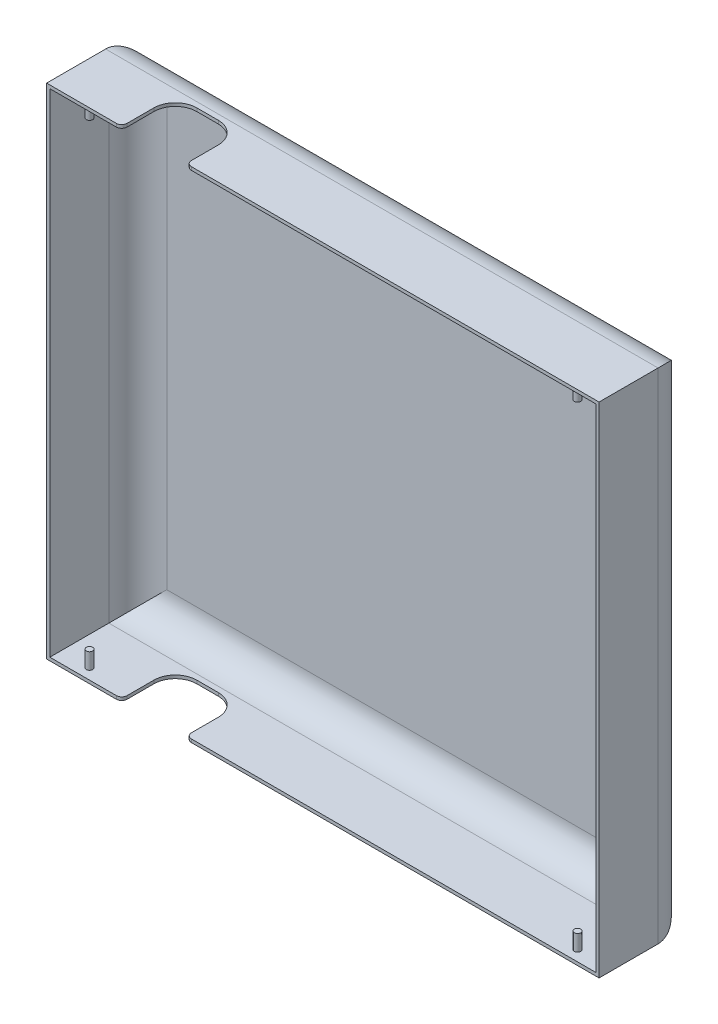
ISO-10303-21;
HEADER;
FILE_DESCRIPTION(('STEP AP214'),'2;1');
FILE_NAME('part.step','',(''),(''),'','','');
FILE_SCHEMA(('AUTOMOTIVE_DESIGN { 1 0 10303 214 1 1 1 1 }'));
ENDSEC;
DATA;
#1=APPLICATION_CONTEXT('core data for automotive mechanical design processes');
#2=APPLICATION_PROTOCOL_DEFINITION('international standard','automotive_design',2000,#1);
#3=PRODUCT_CONTEXT('',#1,'mechanical');
#4=PRODUCT('Part','Part','',(#3));
#5=PRODUCT_RELATED_PRODUCT_CATEGORY('part','',(#4));
#6=PRODUCT_DEFINITION_FORMATION('','',#4);
#7=PRODUCT_DEFINITION_CONTEXT('part definition',#1,'design');
#8=PRODUCT_DEFINITION('design','',#6,#7);
#9=PRODUCT_DEFINITION_SHAPE('','',#8);
#10=(LENGTH_UNIT() NAMED_UNIT(*) SI_UNIT(.MILLI.,.METRE.));
#11=(NAMED_UNIT(*) PLANE_ANGLE_UNIT() SI_UNIT($,.RADIAN.));
#12=(NAMED_UNIT(*) SI_UNIT($,.STERADIAN.) SOLID_ANGLE_UNIT());
#13=UNCERTAINTY_MEASURE_WITH_UNIT(LENGTH_MEASURE(1.E-05),#10,'distance_accuracy_value','');
#14=(GEOMETRIC_REPRESENTATION_CONTEXT(3) GLOBAL_UNCERTAINTY_ASSIGNED_CONTEXT((#13)) GLOBAL_UNIT_ASSIGNED_CONTEXT((#10,
#11,#12)) REPRESENTATION_CONTEXT('',''));
#15=CARTESIAN_POINT('',(0.,0.,0.));
#16=DIRECTION('',(0.,0.,1.));
#17=DIRECTION('',(1.,0.,0.));
#18=AXIS2_PLACEMENT_3D('',#15,#16,#17);
#19=CARTESIAN_POINT('',(0.,-3.,85.));
#20=DIRECTION('',(0.,-1.,0.));
#21=DIRECTION('',(0.,0.,-1.));
#22=AXIS2_PLACEMENT_3D('',#19,#20,#21);
#23=PLANE('',#22);
#24=CARTESIAN_POINT('',(30.,-3.,74.9999999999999));
#25=DIRECTION('',(0.,-1.,0.));
#26=DIRECTION('',(0.,0.,-1.));
#27=AXIS2_PLACEMENT_3D('',#24,#25,#26);
#28=CIRCLE('',#27,3.);
#29=CARTESIAN_POINT('',(30.,-3.,71.9999999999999));
#30=VERTEX_POINT('',#29);
#31=EDGE_CURVE('E886',#30,#30,#28,.T.);
#32=ORIENTED_EDGE('',*,*,#31,.F.);
#33=EDGE_LOOP('',(#32));
#34=FACE_BOUND('',#33,.T.);
#35=DIRECTION('',(-1.,0.,0.));
#36=VECTOR('',#35,1.);
#37=CARTESIAN_POINT('',(0.,-3.,85.));
#38=LINE('',#37,#36);
#39=CARTESIAN_POINT('',(512.,-3.,85.));
#40=VERTEX_POINT('',#39);
#41=CARTESIAN_POINT('',(135.,-3.,85.));
#42=VERTEX_POINT('',#41);
#43=EDGE_CURVE('E286',#40,#42,#38,.T.);
#44=ORIENTED_EDGE('',*,*,#43,.T.);
#45=CARTESIAN_POINT('',(135.,-3.,80.));
#46=DIRECTION('',(0.,-1.,0.));
#47=DIRECTION('',(0.,0.,-1.));
#48=AXIS2_PLACEMENT_3D('',#45,#46,#47);
#49=CIRCLE('',#48,5.);
#50=CARTESIAN_POINT('',(130.,-3.,80.));
#51=VERTEX_POINT('',#50);
#52=EDGE_CURVE('E358',#42,#51,#49,.T.);
#53=ORIENTED_EDGE('',*,*,#52,.T.);
#54=DIRECTION('',(0.,0.,1.));
#55=VECTOR('',#54,1.);
#56=CARTESIAN_POINT('',(130.,-3.,85.));
#57=LINE('',#56,#55);
#58=CARTESIAN_POINT('',(130.,-3.,55.));
#59=VERTEX_POINT('',#58);
#60=EDGE_CURVE('E344',#59,#51,#57,.T.);
#61=ORIENTED_EDGE('',*,*,#60,.F.);
#62=CARTESIAN_POINT('',(110.,-3.,55.));
#63=DIRECTION('',(0.,-1.,0.));
#64=DIRECTION('',(0.,0.,-1.));
#65=AXIS2_PLACEMENT_3D('',#62,#63,#64);
#66=CIRCLE('',#65,20.);
#67=CARTESIAN_POINT('',(110.,-3.,35.));
#68=VERTEX_POINT('',#67);
#69=EDGE_CURVE('E373',#59,#68,#66,.F.);
#70=ORIENTED_EDGE('',*,*,#69,.T.);
#71=DIRECTION('',(1.,0.,0.));
#72=VECTOR('',#71,1.);
#73=CARTESIAN_POINT('',(0.,-3.,35.));
#74=LINE('',#73,#72);
#75=CARTESIAN_POINT('',(90.,-3.,35.));
#76=VERTEX_POINT('',#75);
#77=EDGE_CURVE('E339',#76,#68,#74,.T.);
#78=ORIENTED_EDGE('',*,*,#77,.F.);
#79=CARTESIAN_POINT('',(90.,-3.,55.));
#80=DIRECTION('',(0.,-1.,0.));
#81=DIRECTION('',(0.,0.,-1.));
#82=AXIS2_PLACEMENT_3D('',#79,#80,#81);
#83=CIRCLE('',#82,20.);
#84=CARTESIAN_POINT('',(70.,-3.,55.));
#85=VERTEX_POINT('',#84);
#86=EDGE_CURVE('E383',#76,#85,#83,.F.);
#87=ORIENTED_EDGE('',*,*,#86,.T.);
#88=DIRECTION('',(0.,0.,-1.));
#89=VECTOR('',#88,1.);
#90=CARTESIAN_POINT('',(70.,-3.,85.));
#91=LINE('',#90,#89);
#92=CARTESIAN_POINT('',(70.,-3.,80.));
#93=VERTEX_POINT('',#92);
#94=EDGE_CURVE('E341',#93,#85,#91,.T.);
#95=ORIENTED_EDGE('',*,*,#94,.F.);
#96=CARTESIAN_POINT('',(65.,-3.,80.));
#97=DIRECTION('',(0.,-1.,0.));
#98=DIRECTION('',(0.,0.,-1.));
#99=AXIS2_PLACEMENT_3D('',#96,#97,#98);
#100=CIRCLE('',#99,5.);
#101=CARTESIAN_POINT('',(65.,-3.,85.));
#102=VERTEX_POINT('',#101);
#103=EDGE_CURVE('E356',#93,#102,#100,.T.);
#104=ORIENTED_EDGE('',*,*,#103,.T.);
#105=CARTESIAN_POINT('',(3.,-3.,85.));
#106=VERTEX_POINT('',#105);
#107=EDGE_CURVE('E285',#102,#106,#38,.T.);
#108=ORIENTED_EDGE('',*,*,#107,.T.);
#109=DIRECTION('',(0.,0.,-1.));
#110=VECTOR('',#109,1.);
#111=CARTESIAN_POINT('',(3.,-3.,85.));
#112=LINE('',#111,#110);
#113=CARTESIAN_POINT('',(3.,-3.,30.));
#114=VERTEX_POINT('',#113);
#115=EDGE_CURVE('E262',#106,#114,#112,.T.);
#116=ORIENTED_EDGE('',*,*,#115,.T.);
#117=DIRECTION('',(1.,0.,0.));
#118=VECTOR('',#117,1.);
#119=CARTESIAN_POINT('',(0.,-3.,30.));
#120=LINE('',#119,#118);
#121=CARTESIAN_POINT('',(512.,-3.,30.));
#122=VERTEX_POINT('',#121);
#123=EDGE_CURVE('E227',#122,#114,#120,.F.);
#124=ORIENTED_EDGE('',*,*,#123,.F.);
#125=DIRECTION('',(0.,0.,-1.));
#126=VECTOR('',#125,1.);
#127=CARTESIAN_POINT('',(512.,-3.,85.));
#128=LINE('',#127,#126);
#129=EDGE_CURVE('E257',#40,#122,#128,.T.);
#130=ORIENTED_EDGE('',*,*,#129,.F.);
#131=EDGE_LOOP('',(#44,#53,#61,#70,#78,#87,#95,#104,#108,#116,#124,#130));
#132=FACE_BOUND('',#131,.T.);
#133=CARTESIAN_POINT('',(485.,-3.,75.));
#134=DIRECTION('',(0.,-1.,0.));
#135=DIRECTION('',(0.,0.,-1.));
#136=AXIS2_PLACEMENT_3D('',#133,#134,#135);
#137=CIRCLE('',#136,2.99999999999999);
#138=CARTESIAN_POINT('',(485.,-3.,72.));
#139=VERTEX_POINT('',#138);
#140=EDGE_CURVE('E887',#139,#139,#137,.T.);
#141=ORIENTED_EDGE('',*,*,#140,.F.);
#142=EDGE_LOOP('',(#141));
#143=FACE_BOUND('',#142,.T.);
#144=ADVANCED_FACE('F33',(#34,#132,#143),#23,.T.);
#145=CARTESIAN_POINT('',(0.,-462.,85.));
#146=DIRECTION('',(0.,1.,0.));
#147=DIRECTION('',(0.,0.,1.));
#148=AXIS2_PLACEMENT_3D('',#145,#146,#147);
#149=PLANE('',#148);
#150=CARTESIAN_POINT('',(30.,-462.,75.));
#151=DIRECTION('',(0.,1.,0.));
#152=DIRECTION('',(0.,0.,1.));
#153=AXIS2_PLACEMENT_3D('',#150,#151,#152);
#154=CIRCLE('',#153,3.);
#155=CARTESIAN_POINT('',(30.,-462.,78.));
#156=VERTEX_POINT('',#155);
#157=EDGE_CURVE('E903',#156,#156,#154,.T.);
#158=ORIENTED_EDGE('',*,*,#157,.F.);
#159=EDGE_LOOP('',(#158));
#160=FACE_BOUND('',#159,.T.);
#161=DIRECTION('',(0.,0.,-1.));
#162=VECTOR('',#161,1.);
#163=CARTESIAN_POINT('',(130.,-462.,85.));
#164=LINE('',#163,#162);
#165=CARTESIAN_POINT('',(130.,-462.,80.));
#166=VERTEX_POINT('',#165);
#167=CARTESIAN_POINT('',(130.,-462.,55.));
#168=VERTEX_POINT('',#167);
#169=EDGE_CURVE('E277',#166,#168,#164,.T.);
#170=ORIENTED_EDGE('',*,*,#169,.F.);
#171=CARTESIAN_POINT('',(135.,-462.,80.));
#172=DIRECTION('',(0.,1.,0.));
#173=DIRECTION('',(0.,0.,1.));
#174=AXIS2_PLACEMENT_3D('',#171,#172,#173);
#175=CIRCLE('',#174,5.);
#176=CARTESIAN_POINT('',(135.,-462.,85.));
#177=VERTEX_POINT('',#176);
#178=EDGE_CURVE('E55',#166,#177,#175,.T.);
#179=ORIENTED_EDGE('',*,*,#178,.T.);
#180=DIRECTION('',(1.,0.,0.));
#181=VECTOR('',#180,1.);
#182=CARTESIAN_POINT('',(0.,-462.,85.));
#183=LINE('',#182,#181);
#184=CARTESIAN_POINT('',(512.,-462.,85.));
#185=VERTEX_POINT('',#184);
#186=EDGE_CURVE('E279',#177,#185,#183,.T.);
#187=ORIENTED_EDGE('',*,*,#186,.T.);
#188=DIRECTION('',(0.,0.,-1.));
#189=VECTOR('',#188,1.);
#190=CARTESIAN_POINT('',(512.,-462.,85.));
#191=LINE('',#190,#189);
#192=CARTESIAN_POINT('',(512.,-462.,30.));
#193=VERTEX_POINT('',#192);
#194=EDGE_CURVE('E238',#185,#193,#191,.T.);
#195=ORIENTED_EDGE('',*,*,#194,.T.);
#196=DIRECTION('',(1.,0.,0.));
#197=VECTOR('',#196,1.);
#198=CARTESIAN_POINT('',(0.,-462.,30.));
#199=LINE('',#198,#197);
#200=CARTESIAN_POINT('',(3.00000000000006,-462.,30.));
#201=VERTEX_POINT('',#200);
#202=EDGE_CURVE('E226',#201,#193,#199,.T.);
#203=ORIENTED_EDGE('',*,*,#202,.F.);
#204=DIRECTION('',(0.,0.,-1.));
#205=VECTOR('',#204,1.);
#206=CARTESIAN_POINT('',(3.00000000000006,-462.,85.));
#207=LINE('',#206,#205);
#208=CARTESIAN_POINT('',(3.00000000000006,-462.,85.));
#209=VERTEX_POINT('',#208);
#210=EDGE_CURVE('E230',#209,#201,#207,.T.);
#211=ORIENTED_EDGE('',*,*,#210,.F.);
#212=CARTESIAN_POINT('',(65.,-462.,85.));
#213=VERTEX_POINT('',#212);
#214=EDGE_CURVE('E280',#209,#213,#183,.T.);
#215=ORIENTED_EDGE('',*,*,#214,.T.);
#216=CARTESIAN_POINT('',(65.,-462.,80.));
#217=DIRECTION('',(0.,1.,0.));
#218=DIRECTION('',(0.,0.,1.));
#219=AXIS2_PLACEMENT_3D('',#216,#217,#218);
#220=CIRCLE('',#219,5.);
#221=CARTESIAN_POINT('',(70.,-462.,80.));
#222=VERTEX_POINT('',#221);
#223=EDGE_CURVE('E410',#213,#222,#220,.T.);
#224=ORIENTED_EDGE('',*,*,#223,.T.);
#225=DIRECTION('',(0.,0.,1.));
#226=VECTOR('',#225,1.);
#227=CARTESIAN_POINT('',(70.,-462.,85.));
#228=LINE('',#227,#226);
#229=CARTESIAN_POINT('',(70.,-462.,55.));
#230=VERTEX_POINT('',#229);
#231=EDGE_CURVE('E428',#230,#222,#228,.T.);
#232=ORIENTED_EDGE('',*,*,#231,.F.);
#233=CARTESIAN_POINT('',(90.,-462.,55.));
#234=DIRECTION('',(0.,1.,0.));
#235=DIRECTION('',(0.,0.,1.));
#236=AXIS2_PLACEMENT_3D('',#233,#234,#235);
#237=CIRCLE('',#236,20.);
#238=CARTESIAN_POINT('',(90.,-462.,35.));
#239=VERTEX_POINT('',#238);
#240=EDGE_CURVE('E391',#230,#239,#237,.F.);
#241=ORIENTED_EDGE('',*,*,#240,.T.);
#242=DIRECTION('',(-1.,0.,0.));
#243=VECTOR('',#242,1.);
#244=CARTESIAN_POINT('',(0.,-462.,35.));
#245=LINE('',#244,#243);
#246=CARTESIAN_POINT('',(110.,-462.,35.));
#247=VERTEX_POINT('',#246);
#248=EDGE_CURVE('E431',#247,#239,#245,.T.);
#249=ORIENTED_EDGE('',*,*,#248,.F.);
#250=CARTESIAN_POINT('',(110.,-462.,55.));
#251=DIRECTION('',(0.,1.,0.));
#252=DIRECTION('',(0.,0.,1.));
#253=AXIS2_PLACEMENT_3D('',#250,#251,#252);
#254=CIRCLE('',#253,20.);
#255=EDGE_CURVE('E402',#247,#168,#254,.F.);
#256=ORIENTED_EDGE('',*,*,#255,.T.);
#257=EDGE_LOOP('',(#170,#179,#187,#195,#203,#211,#215,#224,#232,#241,#249,#256));
#258=FACE_BOUND('',#257,.T.);
#259=CARTESIAN_POINT('',(485.,-462.,75.));
#260=DIRECTION('',(0.,1.,0.));
#261=DIRECTION('',(0.,0.,1.));
#262=AXIS2_PLACEMENT_3D('',#259,#260,#261);
#263=CIRCLE('',#262,2.99999999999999);
#264=CARTESIAN_POINT('',(485.,-462.,78.));
#265=VERTEX_POINT('',#264);
#266=EDGE_CURVE('E897',#265,#265,#263,.T.);
#267=ORIENTED_EDGE('',*,*,#266,.F.);
#268=EDGE_LOOP('',(#267));
#269=FACE_BOUND('',#268,.T.);
#270=ADVANCED_FACE('F247',(#160,#258,#269),#149,.T.);
#271=CARTESIAN_POINT('',(0.,-465.,85.));
#272=DIRECTION('',(0.,0.,1.));
#273=DIRECTION('',(1.,0.,0.));
#274=AXIS2_PLACEMENT_3D('',#271,#272,#273);
#275=PLANE('',#274);
#276=ORIENTED_EDGE('',*,*,#186,.F.);
#277=DIRECTION('',(0.,1.,0.));
#278=VECTOR('',#277,1.);
#279=CARTESIAN_POINT('',(135.,-465.,85.));
#280=LINE('',#279,#278);
#281=CARTESIAN_POINT('',(135.,-465.,85.));
#282=VERTEX_POINT('',#281);
#283=EDGE_CURVE('E41',#177,#282,#280,.F.);
#284=ORIENTED_EDGE('',*,*,#283,.T.);
#285=DIRECTION('',(1.,0.,0.));
#286=VECTOR('',#285,1.);
#287=CARTESIAN_POINT('',(0.,-465.,85.));
#288=LINE('',#287,#286);
#289=CARTESIAN_POINT('',(515.,-465.,85.));
#290=VERTEX_POINT('',#289);
#291=EDGE_CURVE('E299',#282,#290,#288,.T.);
#292=ORIENTED_EDGE('',*,*,#291,.T.);
#293=DIRECTION('',(0.,1.,0.));
#294=VECTOR('',#293,1.);
#295=CARTESIAN_POINT('',(515.,0.,85.));
#296=LINE('',#295,#294);
#297=CARTESIAN_POINT('',(515.,0.,85.));
#298=VERTEX_POINT('',#297);
#299=EDGE_CURVE('E303',#290,#298,#296,.T.);
#300=ORIENTED_EDGE('',*,*,#299,.T.);
#301=DIRECTION('',(-1.,0.,0.));
#302=VECTOR('',#301,1.);
#303=CARTESIAN_POINT('',(0.,0.,85.));
#304=LINE('',#303,#302);
#305=CARTESIAN_POINT('',(135.,0.,85.));
#306=VERTEX_POINT('',#305);
#307=EDGE_CURVE('E306',#298,#306,#304,.T.);
#308=ORIENTED_EDGE('',*,*,#307,.T.);
#309=DIRECTION('',(0.,1.,0.));
#310=VECTOR('',#309,1.);
#311=CARTESIAN_POINT('',(135.,-3.,85.));
#312=LINE('',#311,#310);
#313=EDGE_CURVE('E354',#306,#42,#312,.F.);
#314=ORIENTED_EDGE('',*,*,#313,.T.);
#315=ORIENTED_EDGE('',*,*,#43,.F.);
#316=DIRECTION('',(0.,1.,0.));
#317=VECTOR('',#316,1.);
#318=CARTESIAN_POINT('',(512.,0.,85.));
#319=LINE('',#318,#317);
#320=EDGE_CURVE('E282',#185,#40,#319,.T.);
#321=ORIENTED_EDGE('',*,*,#320,.F.);
#322=EDGE_LOOP('',(#276,#284,#292,#300,#308,#314,#315,#321));
#323=FACE_BOUND('',#322,.T.);
#324=ADVANCED_FACE('F489',(#323),#275,.T.);
#325=CARTESIAN_POINT('',(0.,0.,85.));
#326=DIRECTION('',(1.,0.,0.));
#327=DIRECTION('',(0.,1.,0.));
#328=AXIS2_PLACEMENT_3D('',#325,#326,#327);
#329=PLANE('',#328);
#330=DIRECTION('',(0.,0.,-1.));
#331=VECTOR('',#330,1.);
#332=CARTESIAN_POINT('',(0.,0.,85.));
#333=LINE('',#332,#331);
#334=CARTESIAN_POINT('',(0.,0.,85.));
#335=VERTEX_POINT('',#334);
#336=CARTESIAN_POINT('',(0.,0.,30.));
#337=VERTEX_POINT('',#336);
#338=EDGE_CURVE('E309',#335,#337,#333,.T.);
#339=ORIENTED_EDGE('',*,*,#338,.T.);
#340=DIRECTION('',(0.,-1.,0.));
#341=VECTOR('',#340,1.);
#342=CARTESIAN_POINT('',(0.,0.,30.));
#343=LINE('',#342,#341);
#344=CARTESIAN_POINT('',(0.,-465.,30.));
#345=VERTEX_POINT('',#344);
#346=EDGE_CURVE('E335',#337,#345,#343,.T.);
#347=ORIENTED_EDGE('',*,*,#346,.T.);
#348=DIRECTION('',(0.,0.,-1.));
#349=VECTOR('',#348,1.);
#350=CARTESIAN_POINT('',(0.,-465.,85.));
#351=LINE('',#350,#349);
#352=CARTESIAN_POINT('',(0.,-465.,85.));
#353=VERTEX_POINT('',#352);
#354=EDGE_CURVE('E318',#353,#345,#351,.T.);
#355=ORIENTED_EDGE('',*,*,#354,.F.);
#356=DIRECTION('',(0.,-1.,0.));
#357=VECTOR('',#356,1.);
#358=CARTESIAN_POINT('',(0.,0.,85.));
#359=LINE('',#358,#357);
#360=EDGE_CURVE('E296',#335,#353,#359,.T.);
#361=ORIENTED_EDGE('',*,*,#360,.F.);
#362=EDGE_LOOP('',(#339,#347,#355,#361));
#363=FACE_BOUND('',#362,.T.);
#364=ADVANCED_FACE('F35',(#363),#329,.F.);
#365=CARTESIAN_POINT('',(0.,-465.,85.));
#366=DIRECTION('',(0.,1.,0.));
#367=DIRECTION('',(0.,0.,1.));
#368=AXIS2_PLACEMENT_3D('',#365,#366,#367);
#369=PLANE('',#368);
#370=ORIENTED_EDGE('',*,*,#291,.F.);
#371=CARTESIAN_POINT('',(135.,-465.,80.));
#372=DIRECTION('',(0.,1.,0.));
#373=DIRECTION('',(0.,0.,1.));
#374=AXIS2_PLACEMENT_3D('',#371,#372,#373);
#375=CIRCLE('',#374,5.);
#376=CARTESIAN_POINT('',(130.,-465.,80.));
#377=VERTEX_POINT('',#376);
#378=EDGE_CURVE('E11',#282,#377,#375,.F.);
#379=ORIENTED_EDGE('',*,*,#378,.T.);
#380=DIRECTION('',(0.,0.,-1.));
#381=VECTOR('',#380,1.);
#382=CARTESIAN_POINT('',(130.,-465.,85.));
#383=LINE('',#382,#381);
#384=CARTESIAN_POINT('',(130.,-465.,55.));
#385=VERTEX_POINT('',#384);
#386=EDGE_CURVE('E423',#377,#385,#383,.T.);
#387=ORIENTED_EDGE('',*,*,#386,.T.);
#388=CARTESIAN_POINT('',(110.,-465.,55.));
#389=DIRECTION('',(0.,1.,0.));
#390=DIRECTION('',(0.,0.,1.));
#391=AXIS2_PLACEMENT_3D('',#388,#389,#390);
#392=CIRCLE('',#391,20.);
#393=CARTESIAN_POINT('',(110.,-465.,35.));
#394=VERTEX_POINT('',#393);
#395=EDGE_CURVE('E405',#385,#394,#392,.T.);
#396=ORIENTED_EDGE('',*,*,#395,.T.);
#397=DIRECTION('',(-1.,0.,0.));
#398=VECTOR('',#397,1.);
#399=CARTESIAN_POINT('',(130.,-465.,35.));
#400=LINE('',#399,#398);
#401=CARTESIAN_POINT('',(90.,-465.,35.));
#402=VERTEX_POINT('',#401);
#403=EDGE_CURVE('E918',#394,#402,#400,.T.);
#404=ORIENTED_EDGE('',*,*,#403,.T.);
#405=CARTESIAN_POINT('',(90.,-465.,55.));
#406=DIRECTION('',(0.,1.,0.));
#407=DIRECTION('',(0.,0.,1.));
#408=AXIS2_PLACEMENT_3D('',#405,#406,#407);
#409=CIRCLE('',#408,20.);
#410=CARTESIAN_POINT('',(70.,-465.,55.));
#411=VERTEX_POINT('',#410);
#412=EDGE_CURVE('E394',#402,#411,#409,.T.);
#413=ORIENTED_EDGE('',*,*,#412,.T.);
#414=DIRECTION('',(0.,0.,1.));
#415=VECTOR('',#414,1.);
#416=CARTESIAN_POINT('',(70.,-465.,85.));
#417=LINE('',#416,#415);
#418=CARTESIAN_POINT('',(70.,-465.,80.));
#419=VERTEX_POINT('',#418);
#420=EDGE_CURVE('E456',#411,#419,#417,.T.);
#421=ORIENTED_EDGE('',*,*,#420,.T.);
#422=CARTESIAN_POINT('',(65.,-465.,80.));
#423=DIRECTION('',(0.,1.,0.));
#424=DIRECTION('',(0.,0.,1.));
#425=AXIS2_PLACEMENT_3D('',#422,#423,#424);
#426=CIRCLE('',#425,5.);
#427=CARTESIAN_POINT('',(65.,-465.,85.));
#428=VERTEX_POINT('',#427);
#429=EDGE_CURVE('E414',#419,#428,#426,.F.);
#430=ORIENTED_EDGE('',*,*,#429,.T.);
#431=EDGE_CURVE('E300',#353,#428,#288,.T.);
#432=ORIENTED_EDGE('',*,*,#431,.F.);
#433=ORIENTED_EDGE('',*,*,#354,.T.);
#434=DIRECTION('',(1.,0.,0.));
#435=VECTOR('',#434,1.);
#436=CARTESIAN_POINT('',(0.,-465.,30.));
#437=LINE('',#436,#435);
#438=CARTESIAN_POINT('',(515.,-465.,30.));
#439=VERTEX_POINT('',#438);
#440=EDGE_CURVE('E337',#345,#439,#437,.T.);
#441=ORIENTED_EDGE('',*,*,#440,.T.);
#442=DIRECTION('',(0.,0.,-1.));
#443=VECTOR('',#442,1.);
#444=CARTESIAN_POINT('',(515.,-465.,85.));
#445=LINE('',#444,#443);
#446=EDGE_CURVE('E315',#290,#439,#445,.T.);
#447=ORIENTED_EDGE('',*,*,#446,.F.);
#448=EDGE_LOOP('',(#370,#379,#387,#396,#404,#413,#421,#430,#432,#433,#441,#447));
#449=FACE_BOUND('',#448,.T.);
#450=ADVANCED_FACE('F455',(#449),#369,.F.);
#451=CARTESIAN_POINT('',(515.,0.,85.));
#452=DIRECTION('',(-1.,0.,0.));
#453=DIRECTION('',(0.,-1.,0.));
#454=AXIS2_PLACEMENT_3D('',#451,#452,#453);
#455=PLANE('',#454);
#456=ORIENTED_EDGE('',*,*,#446,.T.);
#457=DIRECTION('',(0.,1.,0.));
#458=VECTOR('',#457,1.);
#459=CARTESIAN_POINT('',(515.,0.,30.));
#460=LINE('',#459,#458);
#461=CARTESIAN_POINT('',(515.,0.,30.));
#462=VERTEX_POINT('',#461);
#463=EDGE_CURVE('E321',#439,#462,#460,.T.);
#464=ORIENTED_EDGE('',*,*,#463,.T.);
#465=DIRECTION('',(0.,0.,-1.));
#466=VECTOR('',#465,1.);
#467=CARTESIAN_POINT('',(515.,0.,85.));
#468=LINE('',#467,#466);
#469=EDGE_CURVE('E312',#298,#462,#468,.T.);
#470=ORIENTED_EDGE('',*,*,#469,.F.);
#471=ORIENTED_EDGE('',*,*,#299,.F.);
#472=EDGE_LOOP('',(#456,#464,#470,#471));
#473=FACE_BOUND('',#472,.T.);
#474=ADVANCED_FACE('F482',(#473),#455,.F.);
#475=CARTESIAN_POINT('',(0.,0.,85.));
#476=DIRECTION('',(0.,-1.,0.));
#477=DIRECTION('',(0.,0.,-1.));
#478=AXIS2_PLACEMENT_3D('',#475,#476,#477);
#479=PLANE('',#478);
#480=DIRECTION('',(0.,0.,-1.));
#481=VECTOR('',#480,1.);
#482=CARTESIAN_POINT('',(130.,0.,85.));
#483=LINE('',#482,#481);
#484=CARTESIAN_POINT('',(130.,0.,80.));
#485=VERTEX_POINT('',#484);
#486=CARTESIAN_POINT('',(130.,0.,55.));
#487=VERTEX_POINT('',#486);
#488=EDGE_CURVE('E909',#485,#487,#483,.T.);
#489=ORIENTED_EDGE('',*,*,#488,.F.);
#490=CARTESIAN_POINT('',(135.,0.,80.));
#491=DIRECTION('',(0.,-1.,0.));
#492=DIRECTION('',(0.,0.,-1.));
#493=AXIS2_PLACEMENT_3D('',#490,#491,#492);
#494=CIRCLE('',#493,5.);
#495=EDGE_CURVE('E352',#485,#306,#494,.F.);
#496=ORIENTED_EDGE('',*,*,#495,.T.);
#497=ORIENTED_EDGE('',*,*,#307,.F.);
#498=ORIENTED_EDGE('',*,*,#469,.T.);
#499=DIRECTION('',(-1.,0.,0.));
#500=VECTOR('',#499,1.);
#501=CARTESIAN_POINT('',(0.,0.,30.));
#502=LINE('',#501,#500);
#503=EDGE_CURVE('E333',#462,#337,#502,.T.);
#504=ORIENTED_EDGE('',*,*,#503,.T.);
#505=ORIENTED_EDGE('',*,*,#338,.F.);
#506=CARTESIAN_POINT('',(65.,0.,85.));
#507=VERTEX_POINT('',#506);
#508=EDGE_CURVE('E305',#507,#335,#304,.T.);
#509=ORIENTED_EDGE('',*,*,#508,.F.);
#510=CARTESIAN_POINT('',(65.,0.,80.));
#511=DIRECTION('',(0.,-1.,0.));
#512=DIRECTION('',(0.,0.,-1.));
#513=AXIS2_PLACEMENT_3D('',#510,#511,#512);
#514=CIRCLE('',#513,5.);
#515=CARTESIAN_POINT('',(70.,0.,80.));
#516=VERTEX_POINT('',#515);
#517=EDGE_CURVE('E349',#507,#516,#514,.F.);
#518=ORIENTED_EDGE('',*,*,#517,.T.);
#519=DIRECTION('',(0.,0.,1.));
#520=VECTOR('',#519,1.);
#521=CARTESIAN_POINT('',(70.,0.,85.));
#522=LINE('',#521,#520);
#523=CARTESIAN_POINT('',(70.,0.,55.));
#524=VERTEX_POINT('',#523);
#525=EDGE_CURVE('E915',#524,#516,#522,.T.);
#526=ORIENTED_EDGE('',*,*,#525,.F.);
#527=CARTESIAN_POINT('',(90.,0.,55.));
#528=DIRECTION('',(0.,-1.,0.));
#529=DIRECTION('',(0.,0.,-1.));
#530=AXIS2_PLACEMENT_3D('',#527,#528,#529);
#531=CIRCLE('',#530,20.);
#532=CARTESIAN_POINT('',(90.,0.,35.));
#533=VERTEX_POINT('',#532);
#534=EDGE_CURVE('E381',#524,#533,#531,.T.);
#535=ORIENTED_EDGE('',*,*,#534,.T.);
#536=DIRECTION('',(-1.,0.,0.));
#537=VECTOR('',#536,1.);
#538=CARTESIAN_POINT('',(130.,0.,35.));
#539=LINE('',#538,#537);
#540=CARTESIAN_POINT('',(110.,0.,35.));
#541=VERTEX_POINT('',#540);
#542=EDGE_CURVE('E912',#541,#533,#539,.T.);
#543=ORIENTED_EDGE('',*,*,#542,.F.);
#544=CARTESIAN_POINT('',(110.,0.,55.));
#545=DIRECTION('',(0.,-1.,0.));
#546=DIRECTION('',(0.,0.,-1.));
#547=AXIS2_PLACEMENT_3D('',#544,#545,#546);
#548=CIRCLE('',#547,20.);
#549=EDGE_CURVE('E371',#541,#487,#548,.T.);
#550=ORIENTED_EDGE('',*,*,#549,.T.);
#551=EDGE_LOOP('',(#489,#496,#497,#498,#504,#505,#509,#518,#526,#535,#543,#550));
#552=FACE_BOUND('',#551,.T.);
#553=ADVANCED_FACE('F487',(#552),#479,.F.);
#554=ORIENTED_EDGE('',*,*,#431,.T.);
#555=DIRECTION('',(0.,1.,0.));
#556=VECTOR('',#555,1.);
#557=CARTESIAN_POINT('',(65.,-462.,85.));
#558=LINE('',#557,#556);
#559=EDGE_CURVE('E407',#428,#213,#558,.T.);
#560=ORIENTED_EDGE('',*,*,#559,.T.);
#561=ORIENTED_EDGE('',*,*,#214,.F.);
#562=DIRECTION('',(0.,-1.,0.));
#563=VECTOR('',#562,1.);
#564=CARTESIAN_POINT('',(3.,0.,85.));
#565=LINE('',#564,#563);
#566=EDGE_CURVE('E233',#106,#209,#565,.T.);
#567=ORIENTED_EDGE('',*,*,#566,.F.);
#568=ORIENTED_EDGE('',*,*,#107,.F.);
#569=DIRECTION('',(0.,1.,0.));
#570=VECTOR('',#569,1.);
#571=CARTESIAN_POINT('',(65.,0.,85.));
#572=LINE('',#571,#570);
#573=EDGE_CURVE('E361',#102,#507,#572,.T.);
#574=ORIENTED_EDGE('',*,*,#573,.T.);
#575=ORIENTED_EDGE('',*,*,#508,.T.);
#576=ORIENTED_EDGE('',*,*,#360,.T.);
#577=EDGE_LOOP('',(#554,#560,#561,#567,#568,#574,#575,#576));
#578=FACE_BOUND('',#577,.T.);
#579=ADVANCED_FACE('F441',(#578),#275,.T.);
#580=CARTESIAN_POINT('',(0.,-465.,0.));
#581=DIRECTION('',(0.,0.,1.));
#582=DIRECTION('',(1.,0.,0.));
#583=AXIS2_PLACEMENT_3D('',#580,#581,#582);
#584=PLANE('',#583);
#585=DIRECTION('',(-1.,0.,0.));
#586=VECTOR('',#585,1.);
#587=CARTESIAN_POINT('',(0.,-30.,0.));
#588=LINE('',#587,#586);
#589=CARTESIAN_POINT('',(30.,-30.,0.));
#590=VERTEX_POINT('',#589);
#591=CARTESIAN_POINT('',(485.,-30.,0.));
#592=VERTEX_POINT('',#591);
#593=EDGE_CURVE('E328',#590,#592,#588,.F.);
#594=ORIENTED_EDGE('',*,*,#593,.T.);
#595=DIRECTION('',(0.,1.,0.));
#596=VECTOR('',#595,1.);
#597=CARTESIAN_POINT('',(485.,-465.,0.));
#598=LINE('',#597,#596);
#599=CARTESIAN_POINT('',(485.,-435.,0.));
#600=VERTEX_POINT('',#599);
#601=EDGE_CURVE('E330',#592,#600,#598,.F.);
#602=ORIENTED_EDGE('',*,*,#601,.T.);
#603=DIRECTION('',(1.,0.,0.));
#604=VECTOR('',#603,1.);
#605=CARTESIAN_POINT('',(0.,-435.,0.));
#606=LINE('',#605,#604);
#607=CARTESIAN_POINT('',(30.0000000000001,-435.,0.));
#608=VERTEX_POINT('',#607);
#609=EDGE_CURVE('E324',#600,#608,#606,.F.);
#610=ORIENTED_EDGE('',*,*,#609,.T.);
#611=DIRECTION('',(0.,-1.,0.));
#612=VECTOR('',#611,1.);
#613=CARTESIAN_POINT('',(30.0000000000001,-465.,0.));
#614=LINE('',#613,#612);
#615=EDGE_CURVE('E326',#608,#590,#614,.F.);
#616=ORIENTED_EDGE('',*,*,#615,.T.);
#617=EDGE_LOOP('',(#594,#602,#610,#616));
#618=FACE_BOUND('',#617,.T.);
#619=ADVANCED_FACE('F784',(#618),#584,.F.);
#620=CARTESIAN_POINT('',(30.,0.,30.));
#621=DIRECTION('',(0.,-1.,0.));
#622=DIRECTION('',(1.,0.,0.));
#623=AXIS2_PLACEMENT_3D('',#620,#621,#622);
#624=CYLINDRICAL_SURFACE('',#623,30.);
#625=CARTESIAN_POINT('',(30.,-30.,30.));
#626=DIRECTION('',(-0.707106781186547,-0.707106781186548,0.));
#627=DIRECTION('',(0.707106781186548,-0.707106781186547,0.));
#628=AXIS2_PLACEMENT_3D('',#625,#626,#627);
#629=ELLIPSE('',#628,42.4264068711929,30.);
#630=EDGE_CURVE('E290',#590,#337,#629,.F.);
#631=ORIENTED_EDGE('',*,*,#630,.F.);
#632=ORIENTED_EDGE('',*,*,#615,.F.);
#633=CARTESIAN_POINT('',(30.0000000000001,-435.,30.));
#634=DIRECTION('',(0.707106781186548,-0.707106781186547,0.));
#635=DIRECTION('',(0.707106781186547,0.707106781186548,0.));
#636=AXIS2_PLACEMENT_3D('',#633,#634,#635);
#637=ELLIPSE('',#636,42.4264068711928,30.);
#638=EDGE_CURVE('E293',#345,#608,#637,.T.);
#639=ORIENTED_EDGE('',*,*,#638,.F.);
#640=ORIENTED_EDGE('',*,*,#346,.F.);
#641=EDGE_LOOP('',(#631,#632,#639,#640));
#642=FACE_BOUND('',#641,.T.);
#643=ADVANCED_FACE('F469',(#642),#624,.T.);
#644=CARTESIAN_POINT('',(0.,-435.,30.));
#645=DIRECTION('',(1.,0.,0.));
#646=DIRECTION('',(0.,0.,-1.));
#647=AXIS2_PLACEMENT_3D('',#644,#645,#646);
#648=CYLINDRICAL_SURFACE('',#647,30.);
#649=ORIENTED_EDGE('',*,*,#638,.T.);
#650=ORIENTED_EDGE('',*,*,#609,.F.);
#651=CARTESIAN_POINT('',(485.,-435.,30.));
#652=DIRECTION('',(0.707106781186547,0.707106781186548,0.));
#653=DIRECTION('',(0.707106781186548,-0.707106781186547,0.));
#654=AXIS2_PLACEMENT_3D('',#651,#652,#653);
#655=ELLIPSE('',#654,42.4264068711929,30.);
#656=EDGE_CURVE('E253',#439,#600,#655,.T.);
#657=ORIENTED_EDGE('',*,*,#656,.F.);
#658=ORIENTED_EDGE('',*,*,#440,.F.);
#659=EDGE_LOOP('',(#649,#650,#657,#658));
#660=FACE_BOUND('',#659,.T.);
#661=ADVANCED_FACE('F473',(#660),#648,.T.);
#662=CARTESIAN_POINT('',(0.,-30.,30.));
#663=DIRECTION('',(-1.,0.,0.));
#664=DIRECTION('',(0.,0.,1.));
#665=AXIS2_PLACEMENT_3D('',#662,#663,#664);
#666=CYLINDRICAL_SURFACE('',#665,30.);
#667=ORIENTED_EDGE('',*,*,#630,.T.);
#668=ORIENTED_EDGE('',*,*,#503,.F.);
#669=CARTESIAN_POINT('',(485.,-30.,30.));
#670=DIRECTION('',(-0.707106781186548,0.707106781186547,0.));
#671=DIRECTION('',(-0.707106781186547,-0.707106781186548,0.));
#672=AXIS2_PLACEMENT_3D('',#669,#670,#671);
#673=ELLIPSE('',#672,42.4264068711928,30.);
#674=EDGE_CURVE('E251',#592,#462,#673,.F.);
#675=ORIENTED_EDGE('',*,*,#674,.F.);
#676=ORIENTED_EDGE('',*,*,#593,.F.);
#677=EDGE_LOOP('',(#667,#668,#675,#676));
#678=FACE_BOUND('',#677,.T.);
#679=ADVANCED_FACE('F772',(#678),#666,.T.);
#680=CARTESIAN_POINT('',(485.,0.,30.));
#681=DIRECTION('',(0.,1.,0.));
#682=DIRECTION('',(-1.,0.,0.));
#683=AXIS2_PLACEMENT_3D('',#680,#681,#682);
#684=CYLINDRICAL_SURFACE('',#683,30.);
#685=ORIENTED_EDGE('',*,*,#656,.T.);
#686=ORIENTED_EDGE('',*,*,#601,.F.);
#687=ORIENTED_EDGE('',*,*,#674,.T.);
#688=ORIENTED_EDGE('',*,*,#463,.F.);
#689=EDGE_LOOP('',(#685,#686,#687,#688));
#690=FACE_BOUND('',#689,.T.);
#691=ADVANCED_FACE('F477',(#690),#684,.T.);
#692=CARTESIAN_POINT('',(3.,0.,85.));
#693=DIRECTION('',(1.,0.,0.));
#694=DIRECTION('',(0.,1.,0.));
#695=AXIS2_PLACEMENT_3D('',#692,#693,#694);
#696=PLANE('',#695);
#697=ORIENTED_EDGE('',*,*,#115,.F.);
#698=ORIENTED_EDGE('',*,*,#566,.T.);
#699=ORIENTED_EDGE('',*,*,#210,.T.);
#700=DIRECTION('',(0.,1.,0.));
#701=VECTOR('',#700,1.);
#702=CARTESIAN_POINT('',(3.,0.,30.));
#703=LINE('',#702,#701);
#704=EDGE_CURVE('E217',#114,#201,#703,.F.);
#705=ORIENTED_EDGE('',*,*,#704,.F.);
#706=EDGE_LOOP('',(#697,#698,#699,#705));
#707=FACE_BOUND('',#706,.T.);
#708=ADVANCED_FACE('F231',(#707),#696,.T.);
#709=CARTESIAN_POINT('',(512.,0.,85.));
#710=DIRECTION('',(-1.,0.,0.));
#711=DIRECTION('',(0.,-1.,0.));
#712=AXIS2_PLACEMENT_3D('',#709,#710,#711);
#713=PLANE('',#712);
#714=ORIENTED_EDGE('',*,*,#194,.F.);
#715=ORIENTED_EDGE('',*,*,#320,.T.);
#716=ORIENTED_EDGE('',*,*,#129,.T.);
#717=DIRECTION('',(0.,-1.,0.));
#718=VECTOR('',#717,1.);
#719=CARTESIAN_POINT('',(512.,0.,30.));
#720=LINE('',#719,#718);
#721=EDGE_CURVE('E237',#193,#122,#720,.F.);
#722=ORIENTED_EDGE('',*,*,#721,.F.);
#723=EDGE_LOOP('',(#714,#715,#716,#722));
#724=FACE_BOUND('',#723,.T.);
#725=ADVANCED_FACE('F499',(#724),#713,.T.);
#726=CARTESIAN_POINT('',(0.,-465.,3.));
#727=DIRECTION('',(0.,0.,1.));
#728=DIRECTION('',(1.,0.,0.));
#729=AXIS2_PLACEMENT_3D('',#726,#727,#728);
#730=PLANE('',#729);
#731=DIRECTION('',(1.,0.,0.));
#732=VECTOR('',#731,1.);
#733=CARTESIAN_POINT('',(0.,-30.,3.));
#734=LINE('',#733,#732);
#735=CARTESIAN_POINT('',(30.,-30.,3.));
#736=VERTEX_POINT('',#735);
#737=CARTESIAN_POINT('',(485.,-30.,3.));
#738=VERTEX_POINT('',#737);
#739=EDGE_CURVE('E268',#736,#738,#734,.T.);
#740=ORIENTED_EDGE('',*,*,#739,.F.);
#741=DIRECTION('',(0.,1.,0.));
#742=VECTOR('',#741,1.);
#743=CARTESIAN_POINT('',(30.0000000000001,-465.,3.));
#744=LINE('',#743,#742);
#745=CARTESIAN_POINT('',(30.0000000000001,-435.,3.));
#746=VERTEX_POINT('',#745);
#747=EDGE_CURVE('E267',#746,#736,#744,.T.);
#748=ORIENTED_EDGE('',*,*,#747,.F.);
#749=DIRECTION('',(1.,0.,0.));
#750=VECTOR('',#749,1.);
#751=CARTESIAN_POINT('',(0.,-435.,3.));
#752=LINE('',#751,#750);
#753=CARTESIAN_POINT('',(485.,-435.,3.));
#754=VERTEX_POINT('',#753);
#755=EDGE_CURVE('E244',#754,#746,#752,.F.);
#756=ORIENTED_EDGE('',*,*,#755,.F.);
#757=DIRECTION('',(0.,1.,0.));
#758=VECTOR('',#757,1.);
#759=CARTESIAN_POINT('',(485.,-465.,3.));
#760=LINE('',#759,#758);
#761=EDGE_CURVE('E264',#738,#754,#760,.F.);
#762=ORIENTED_EDGE('',*,*,#761,.F.);
#763=EDGE_LOOP('',(#740,#748,#756,#762));
#764=FACE_BOUND('',#763,.T.);
#765=ADVANCED_FACE('F507',(#764),#730,.T.);
#766=CARTESIAN_POINT('',(30.,0.,30.));
#767=DIRECTION('',(0.,-1.,0.));
#768=DIRECTION('',(1.,0.,0.));
#769=AXIS2_PLACEMENT_3D('',#766,#767,#768);
#770=CYLINDRICAL_SURFACE('',#769,27.);
#771=CARTESIAN_POINT('',(30.,-30.,30.));
#772=DIRECTION('',(-0.707106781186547,-0.707106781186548,0.));
#773=DIRECTION('',(-0.707106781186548,0.707106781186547,0.));
#774=AXIS2_PLACEMENT_3D('',#771,#772,#773);
#775=ELLIPSE('',#774,38.1837661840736,27.);
#776=EDGE_CURVE('E223',#736,#114,#775,.F.);
#777=ORIENTED_EDGE('',*,*,#776,.T.);
#778=ORIENTED_EDGE('',*,*,#704,.T.);
#779=CARTESIAN_POINT('',(30.0000000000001,-435.,30.));
#780=DIRECTION('',(0.707106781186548,-0.707106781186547,0.));
#781=DIRECTION('',(0.707106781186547,0.707106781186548,0.));
#782=AXIS2_PLACEMENT_3D('',#779,#780,#781);
#783=ELLIPSE('',#782,38.1837661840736,27.);
#784=EDGE_CURVE('E221',#201,#746,#783,.T.);
#785=ORIENTED_EDGE('',*,*,#784,.T.);
#786=ORIENTED_EDGE('',*,*,#747,.T.);
#787=EDGE_LOOP('',(#777,#778,#785,#786));
#788=FACE_BOUND('',#787,.T.);
#789=ADVANCED_FACE('F219',(#788),#770,.F.);
#790=CARTESIAN_POINT('',(0.,-435.,30.));
#791=DIRECTION('',(1.,0.,0.));
#792=DIRECTION('',(0.,0.,-1.));
#793=AXIS2_PLACEMENT_3D('',#790,#791,#792);
#794=CYLINDRICAL_SURFACE('',#793,27.);
#795=ORIENTED_EDGE('',*,*,#784,.F.);
#796=ORIENTED_EDGE('',*,*,#202,.T.);
#797=CARTESIAN_POINT('',(485.,-435.,30.));
#798=DIRECTION('',(0.707106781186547,0.707106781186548,0.));
#799=DIRECTION('',(-0.707106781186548,0.707106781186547,0.));
#800=AXIS2_PLACEMENT_3D('',#797,#798,#799);
#801=ELLIPSE('',#800,38.1837661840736,27.);
#802=EDGE_CURVE('E266',#193,#754,#801,.T.);
#803=ORIENTED_EDGE('',*,*,#802,.T.);
#804=ORIENTED_EDGE('',*,*,#755,.T.);
#805=EDGE_LOOP('',(#795,#796,#803,#804));
#806=FACE_BOUND('',#805,.T.);
#807=ADVANCED_FACE('F241',(#806),#794,.F.);
#808=CARTESIAN_POINT('',(0.,-30.,30.));
#809=DIRECTION('',(-1.,0.,0.));
#810=DIRECTION('',(0.,0.,1.));
#811=AXIS2_PLACEMENT_3D('',#808,#809,#810);
#812=CYLINDRICAL_SURFACE('',#811,27.);
#813=ORIENTED_EDGE('',*,*,#776,.F.);
#814=ORIENTED_EDGE('',*,*,#739,.T.);
#815=CARTESIAN_POINT('',(485.,-30.,30.));
#816=DIRECTION('',(-0.707106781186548,0.707106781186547,0.));
#817=DIRECTION('',(0.707106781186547,0.707106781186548,0.));
#818=AXIS2_PLACEMENT_3D('',#815,#816,#817);
#819=ELLIPSE('',#818,38.1837661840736,27.);
#820=EDGE_CURVE('E275',#738,#122,#819,.F.);
#821=ORIENTED_EDGE('',*,*,#820,.T.);
#822=ORIENTED_EDGE('',*,*,#123,.T.);
#823=EDGE_LOOP('',(#813,#814,#821,#822));
#824=FACE_BOUND('',#823,.T.);
#825=ADVANCED_FACE('F509',(#824),#812,.F.);
#826=CARTESIAN_POINT('',(485.,0.,30.));
#827=DIRECTION('',(0.,1.,0.));
#828=DIRECTION('',(-1.,0.,0.));
#829=AXIS2_PLACEMENT_3D('',#826,#827,#828);
#830=CYLINDRICAL_SURFACE('',#829,27.);
#831=ORIENTED_EDGE('',*,*,#802,.F.);
#832=ORIENTED_EDGE('',*,*,#721,.T.);
#833=ORIENTED_EDGE('',*,*,#820,.F.);
#834=ORIENTED_EDGE('',*,*,#761,.T.);
#835=EDGE_LOOP('',(#831,#832,#833,#834));
#836=FACE_BOUND('',#835,.T.);
#837=ADVANCED_FACE('F503',(#836),#830,.F.);
#838=CARTESIAN_POINT('',(130.,-465.,35.));
#839=DIRECTION('',(0.,0.,-1.));
#840=DIRECTION('',(-1.,0.,0.));
#841=AXIS2_PLACEMENT_3D('',#838,#839,#840);
#842=PLANE('',#841);
#843=ORIENTED_EDGE('',*,*,#542,.T.);
#844=DIRECTION('',(0.,1.,0.));
#845=VECTOR('',#844,1.);
#846=CARTESIAN_POINT('',(90.,-3.,35.));
#847=LINE('',#846,#845);
#848=EDGE_CURVE('E379',#533,#76,#847,.F.);
#849=ORIENTED_EDGE('',*,*,#848,.T.);
#850=ORIENTED_EDGE('',*,*,#77,.T.);
#851=DIRECTION('',(0.,1.,0.));
#852=VECTOR('',#851,1.);
#853=CARTESIAN_POINT('',(110.,0.,35.));
#854=LINE('',#853,#852);
#855=EDGE_CURVE('E366',#68,#541,#854,.T.);
#856=ORIENTED_EDGE('',*,*,#855,.T.);
#857=EDGE_LOOP('',(#843,#849,#850,#856));
#858=FACE_BOUND('',#857,.T.);
#859=ADVANCED_FACE('F516',(#858),#842,.F.);
#860=CARTESIAN_POINT('',(70.,-465.,85.));
#861=DIRECTION('',(-1.,0.,0.));
#862=DIRECTION('',(0.,0.,1.));
#863=AXIS2_PLACEMENT_3D('',#860,#861,#862);
#864=PLANE('',#863);
#865=ORIENTED_EDGE('',*,*,#94,.T.);
#866=DIRECTION('',(0.,1.,0.));
#867=VECTOR('',#866,1.);
#868=CARTESIAN_POINT('',(70.,0.,55.));
#869=LINE('',#868,#867);
#870=EDGE_CURVE('E376',#85,#524,#869,.T.);
#871=ORIENTED_EDGE('',*,*,#870,.T.);
#872=ORIENTED_EDGE('',*,*,#525,.T.);
#873=DIRECTION('',(0.,1.,0.));
#874=VECTOR('',#873,1.);
#875=CARTESIAN_POINT('',(70.,-3.,80.));
#876=LINE('',#875,#874);
#877=EDGE_CURVE('E364',#516,#93,#876,.F.);
#878=ORIENTED_EDGE('',*,*,#877,.T.);
#879=EDGE_LOOP('',(#865,#871,#872,#878));
#880=FACE_BOUND('',#879,.T.);
#881=ADVANCED_FACE('F562',(#880),#864,.F.);
#882=CARTESIAN_POINT('',(130.,-465.,85.));
#883=DIRECTION('',(1.,0.,0.));
#884=DIRECTION('',(0.,0.,-1.));
#885=AXIS2_PLACEMENT_3D('',#882,#883,#884);
#886=PLANE('',#885);
#887=ORIENTED_EDGE('',*,*,#488,.T.);
#888=DIRECTION('',(0.,1.,0.));
#889=VECTOR('',#888,1.);
#890=CARTESIAN_POINT('',(130.,-3.,55.));
#891=LINE('',#890,#889);
#892=EDGE_CURVE('E369',#487,#59,#891,.F.);
#893=ORIENTED_EDGE('',*,*,#892,.T.);
#894=ORIENTED_EDGE('',*,*,#60,.T.);
#895=DIRECTION('',(0.,1.,0.));
#896=VECTOR('',#895,1.);
#897=CARTESIAN_POINT('',(130.,0.,80.));
#898=LINE('',#897,#896);
#899=EDGE_CURVE('E346',#51,#485,#898,.T.);
#900=ORIENTED_EDGE('',*,*,#899,.T.);
#901=EDGE_LOOP('',(#887,#893,#894,#900));
#902=FACE_BOUND('',#901,.T.);
#903=ADVANCED_FACE('F573',(#902),#886,.F.);
#904=ORIENTED_EDGE('',*,*,#386,.F.);
#905=DIRECTION('',(0.,1.,0.));
#906=VECTOR('',#905,1.);
#907=CARTESIAN_POINT('',(130.,-462.,80.));
#908=LINE('',#907,#906);
#909=EDGE_CURVE('E416',#377,#166,#908,.T.);
#910=ORIENTED_EDGE('',*,*,#909,.T.);
#911=ORIENTED_EDGE('',*,*,#169,.T.);
#912=DIRECTION('',(0.,1.,0.));
#913=VECTOR('',#912,1.);
#914=CARTESIAN_POINT('',(130.,-465.,55.));
#915=LINE('',#914,#913);
#916=EDGE_CURVE('E399',#168,#385,#915,.F.);
#917=ORIENTED_EDGE('',*,*,#916,.T.);
#918=EDGE_LOOP('',(#904,#910,#911,#917));
#919=FACE_BOUND('',#918,.T.);
#920=ADVANCED_FACE('F422',(#919),#886,.F.);
#921=ORIENTED_EDGE('',*,*,#231,.T.);
#922=DIRECTION('',(0.,1.,0.));
#923=VECTOR('',#922,1.);
#924=CARTESIAN_POINT('',(70.,-465.,80.));
#925=LINE('',#924,#923);
#926=EDGE_CURVE('E412',#222,#419,#925,.F.);
#927=ORIENTED_EDGE('',*,*,#926,.T.);
#928=ORIENTED_EDGE('',*,*,#420,.F.);
#929=DIRECTION('',(0.,1.,0.));
#930=VECTOR('',#929,1.);
#931=CARTESIAN_POINT('',(70.,-462.,55.));
#932=LINE('',#931,#930);
#933=EDGE_CURVE('E385',#411,#230,#932,.T.);
#934=ORIENTED_EDGE('',*,*,#933,.T.);
#935=EDGE_LOOP('',(#921,#927,#928,#934));
#936=FACE_BOUND('',#935,.T.);
#937=ADVANCED_FACE('F448',(#936),#864,.F.);
#938=ORIENTED_EDGE('',*,*,#403,.F.);
#939=DIRECTION('',(0.,1.,0.));
#940=VECTOR('',#939,1.);
#941=CARTESIAN_POINT('',(110.,-462.,35.));
#942=LINE('',#941,#940);
#943=EDGE_CURVE('E396',#394,#247,#942,.T.);
#944=ORIENTED_EDGE('',*,*,#943,.T.);
#945=ORIENTED_EDGE('',*,*,#248,.T.);
#946=DIRECTION('',(0.,1.,0.));
#947=VECTOR('',#946,1.);
#948=CARTESIAN_POINT('',(90.,-465.,35.));
#949=LINE('',#948,#947);
#950=EDGE_CURVE('E388',#239,#402,#949,.F.);
#951=ORIENTED_EDGE('',*,*,#950,.T.);
#952=EDGE_LOOP('',(#938,#944,#945,#951));
#953=FACE_BOUND('',#952,.T.);
#954=ADVANCED_FACE('F565',(#953),#842,.F.);
#955=CARTESIAN_POINT('',(135.,-465.,80.));
#956=DIRECTION('',(0.,-1.,0.));
#957=DIRECTION('',(0.,0.,-1.));
#958=AXIS2_PLACEMENT_3D('',#955,#956,#957);
#959=CYLINDRICAL_SURFACE('',#958,5.);
#960=ORIENTED_EDGE('',*,*,#52,.F.);
#961=ORIENTED_EDGE('',*,*,#313,.F.);
#962=ORIENTED_EDGE('',*,*,#495,.F.);
#963=ORIENTED_EDGE('',*,*,#899,.F.);
#964=EDGE_LOOP('',(#960,#961,#962,#963));
#965=FACE_BOUND('',#964,.T.);
#966=ADVANCED_FACE('F493',(#965),#959,.T.);
#967=CARTESIAN_POINT('',(65.,-465.,80.));
#968=DIRECTION('',(0.,-1.,0.));
#969=DIRECTION('',(0.,0.,-1.));
#970=AXIS2_PLACEMENT_3D('',#967,#968,#969);
#971=CYLINDRICAL_SURFACE('',#970,5.);
#972=ORIENTED_EDGE('',*,*,#103,.F.);
#973=ORIENTED_EDGE('',*,*,#877,.F.);
#974=ORIENTED_EDGE('',*,*,#517,.F.);
#975=ORIENTED_EDGE('',*,*,#573,.F.);
#976=EDGE_LOOP('',(#972,#973,#974,#975));
#977=FACE_BOUND('',#976,.T.);
#978=ADVANCED_FACE('F614',(#977),#971,.T.);
#979=CARTESIAN_POINT('',(110.,-465.,55.));
#980=DIRECTION('',(0.,-1.,0.));
#981=DIRECTION('',(0.,0.,-1.));
#982=AXIS2_PLACEMENT_3D('',#979,#980,#981);
#983=CYLINDRICAL_SURFACE('',#982,20.);
#984=ORIENTED_EDGE('',*,*,#69,.F.);
#985=ORIENTED_EDGE('',*,*,#892,.F.);
#986=ORIENTED_EDGE('',*,*,#549,.F.);
#987=ORIENTED_EDGE('',*,*,#855,.F.);
#988=EDGE_LOOP('',(#984,#985,#986,#987));
#989=FACE_BOUND('',#988,.T.);
#990=ADVANCED_FACE('F623',(#989),#983,.F.);
#991=CARTESIAN_POINT('',(90.,-465.,55.));
#992=DIRECTION('',(0.,-1.,0.));
#993=DIRECTION('',(0.,0.,-1.));
#994=AXIS2_PLACEMENT_3D('',#991,#992,#993);
#995=CYLINDRICAL_SURFACE('',#994,20.);
#996=ORIENTED_EDGE('',*,*,#86,.F.);
#997=ORIENTED_EDGE('',*,*,#848,.F.);
#998=ORIENTED_EDGE('',*,*,#534,.F.);
#999=ORIENTED_EDGE('',*,*,#870,.F.);
#1000=EDGE_LOOP('',(#996,#997,#998,#999));
#1001=FACE_BOUND('',#1000,.T.);
#1002=ADVANCED_FACE('F633',(#1001),#995,.F.);
#1003=CARTESIAN_POINT('',(90.,-465.,55.));
#1004=DIRECTION('',(0.,-1.,0.));
#1005=DIRECTION('',(0.,0.,-1.));
#1006=AXIS2_PLACEMENT_3D('',#1003,#1004,#1005);
#1007=CYLINDRICAL_SURFACE('',#1006,20.);
#1008=ORIENTED_EDGE('',*,*,#412,.F.);
#1009=ORIENTED_EDGE('',*,*,#950,.F.);
#1010=ORIENTED_EDGE('',*,*,#240,.F.);
#1011=ORIENTED_EDGE('',*,*,#933,.F.);
#1012=EDGE_LOOP('',(#1008,#1009,#1010,#1011));
#1013=FACE_BOUND('',#1012,.T.);
#1014=ADVANCED_FACE('F643',(#1013),#1007,.F.);
#1015=CARTESIAN_POINT('',(110.,-465.,55.));
#1016=DIRECTION('',(0.,-1.,0.));
#1017=DIRECTION('',(0.,0.,-1.));
#1018=AXIS2_PLACEMENT_3D('',#1015,#1016,#1017);
#1019=CYLINDRICAL_SURFACE('',#1018,20.);
#1020=ORIENTED_EDGE('',*,*,#395,.F.);
#1021=ORIENTED_EDGE('',*,*,#916,.F.);
#1022=ORIENTED_EDGE('',*,*,#255,.F.);
#1023=ORIENTED_EDGE('',*,*,#943,.F.);
#1024=EDGE_LOOP('',(#1020,#1021,#1022,#1023));
#1025=FACE_BOUND('',#1024,.T.);
#1026=ADVANCED_FACE('F653',(#1025),#1019,.F.);
#1027=CARTESIAN_POINT('',(65.,-465.,80.));
#1028=DIRECTION('',(0.,-1.,0.));
#1029=DIRECTION('',(0.,0.,-1.));
#1030=AXIS2_PLACEMENT_3D('',#1027,#1028,#1029);
#1031=CYLINDRICAL_SURFACE('',#1030,5.);
#1032=ORIENTED_EDGE('',*,*,#429,.F.);
#1033=ORIENTED_EDGE('',*,*,#926,.F.);
#1034=ORIENTED_EDGE('',*,*,#223,.F.);
#1035=ORIENTED_EDGE('',*,*,#559,.F.);
#1036=EDGE_LOOP('',(#1032,#1033,#1034,#1035));
#1037=FACE_BOUND('',#1036,.T.);
#1038=ADVANCED_FACE('F453',(#1037),#1031,.T.);
#1039=CARTESIAN_POINT('',(135.,-465.,80.));
#1040=DIRECTION('',(0.,-1.,0.));
#1041=DIRECTION('',(0.,0.,-1.));
#1042=AXIS2_PLACEMENT_3D('',#1039,#1040,#1041);
#1043=CYLINDRICAL_SURFACE('',#1042,5.);
#1044=ORIENTED_EDGE('',*,*,#378,.F.);
#1045=ORIENTED_EDGE('',*,*,#283,.F.);
#1046=ORIENTED_EDGE('',*,*,#178,.F.);
#1047=ORIENTED_EDGE('',*,*,#909,.F.);
#1048=EDGE_LOOP('',(#1044,#1045,#1046,#1047));
#1049=FACE_BOUND('',#1048,.T.);
#1050=ADVANCED_FACE('F672',(#1049),#1043,.T.);
#1051=CARTESIAN_POINT('',(30.,-447.,75.));
#1052=DIRECTION('',(0.,-1.,0.));
#1053=DIRECTION('',(0.,0.,-1.));
#1054=AXIS2_PLACEMENT_3D('',#1051,#1052,#1053);
#1055=CYLINDRICAL_SURFACE('',#1054,3.);
#1056=CARTESIAN_POINT('',(30.,-447.,75.));
#1057=DIRECTION('',(0.,1.,0.));
#1058=DIRECTION('',(0.,0.,1.));
#1059=AXIS2_PLACEMENT_3D('',#1056,#1057,#1058);
#1060=CIRCLE('',#1059,3.);
#1061=CARTESIAN_POINT('',(30.,-447.,78.));
#1062=VERTEX_POINT('',#1061);
#1063=EDGE_CURVE('E906',#1062,#1062,#1060,.T.);
#1064=ORIENTED_EDGE('',*,*,#1063,.F.);
#1065=EDGE_LOOP('',(#1064));
#1066=FACE_BOUND('',#1065,.T.);
#1067=ORIENTED_EDGE('',*,*,#157,.T.);
#1068=EDGE_LOOP('',(#1067));
#1069=FACE_BOUND('',#1068,.T.);
#1070=ADVANCED_FACE('F681',(#1066,#1069),#1055,.T.);
#1071=CARTESIAN_POINT('',(30.,-447.,75.));
#1072=DIRECTION('',(0.,1.,0.));
#1073=DIRECTION('',(0.,0.,1.));
#1074=AXIS2_PLACEMENT_3D('',#1071,#1072,#1073);
#1075=PLANE('',#1074);
#1076=ORIENTED_EDGE('',*,*,#1063,.T.);
#1077=EDGE_LOOP('',(#1076));
#1078=FACE_BOUND('',#1077,.T.);
#1079=ADVANCED_FACE('F691',(#1078),#1075,.T.);
#1080=CARTESIAN_POINT('',(485.,-447.,75.));
#1081=DIRECTION('',(0.,-1.,0.));
#1082=DIRECTION('',(0.,0.,-1.));
#1083=AXIS2_PLACEMENT_3D('',#1080,#1081,#1082);
#1084=CYLINDRICAL_SURFACE('',#1083,2.99999999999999);
#1085=CARTESIAN_POINT('',(485.,-447.,75.));
#1086=DIRECTION('',(0.,1.,0.));
#1087=DIRECTION('',(0.,0.,1.));
#1088=AXIS2_PLACEMENT_3D('',#1085,#1086,#1087);
#1089=CIRCLE('',#1088,2.99999999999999);
#1090=CARTESIAN_POINT('',(485.,-447.,78.));
#1091=VERTEX_POINT('',#1090);
#1092=EDGE_CURVE('E900',#1091,#1091,#1089,.T.);
#1093=ORIENTED_EDGE('',*,*,#1092,.F.);
#1094=EDGE_LOOP('',(#1093));
#1095=FACE_BOUND('',#1094,.T.);
#1096=ORIENTED_EDGE('',*,*,#266,.T.);
#1097=EDGE_LOOP('',(#1096));
#1098=FACE_BOUND('',#1097,.T.);
#1099=ADVANCED_FACE('F701',(#1095,#1098),#1084,.T.);
#1100=CARTESIAN_POINT('',(485.,-447.,75.));
#1101=DIRECTION('',(0.,1.,0.));
#1102=DIRECTION('',(0.,0.,1.));
#1103=AXIS2_PLACEMENT_3D('',#1100,#1101,#1102);
#1104=PLANE('',#1103);
#1105=ORIENTED_EDGE('',*,*,#1092,.T.);
#1106=EDGE_LOOP('',(#1105));
#1107=FACE_BOUND('',#1106,.T.);
#1108=ADVANCED_FACE('F711',(#1107),#1104,.T.);
#1109=CARTESIAN_POINT('',(30.,-18.,74.9999999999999));
#1110=DIRECTION('',(0.,1.,0.));
#1111=DIRECTION('',(0.,0.,1.));
#1112=AXIS2_PLACEMENT_3D('',#1109,#1110,#1111);
#1113=CYLINDRICAL_SURFACE('',#1112,3.);
#1114=CARTESIAN_POINT('',(30.,-18.,74.9999999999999));
#1115=DIRECTION('',(0.,-1.,0.));
#1116=DIRECTION('',(0.,0.,-1.));
#1117=AXIS2_PLACEMENT_3D('',#1114,#1115,#1116);
#1118=CIRCLE('',#1117,3.);
#1119=CARTESIAN_POINT('',(30.,-18.,71.9999999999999));
#1120=VERTEX_POINT('',#1119);
#1121=EDGE_CURVE('E890',#1120,#1120,#1118,.T.);
#1122=ORIENTED_EDGE('',*,*,#1121,.F.);
#1123=EDGE_LOOP('',(#1122));
#1124=FACE_BOUND('',#1123,.T.);
#1125=ORIENTED_EDGE('',*,*,#31,.T.);
#1126=EDGE_LOOP('',(#1125));
#1127=FACE_BOUND('',#1126,.T.);
#1128=ADVANCED_FACE('F721',(#1124,#1127),#1113,.T.);
#1129=CARTESIAN_POINT('',(30.,-18.,74.9999999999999));
#1130=DIRECTION('',(0.,-1.,0.));
#1131=DIRECTION('',(0.,0.,-1.));
#1132=AXIS2_PLACEMENT_3D('',#1129,#1130,#1131);
#1133=PLANE('',#1132);
#1134=ORIENTED_EDGE('',*,*,#1121,.T.);
#1135=EDGE_LOOP('',(#1134));
#1136=FACE_BOUND('',#1135,.T.);
#1137=ADVANCED_FACE('F732',(#1136),#1133,.T.);
#1138=CARTESIAN_POINT('',(485.,-18.,75.));
#1139=DIRECTION('',(0.,1.,0.));
#1140=DIRECTION('',(0.,0.,1.));
#1141=AXIS2_PLACEMENT_3D('',#1138,#1139,#1140);
#1142=CYLINDRICAL_SURFACE('',#1141,2.99999999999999);
#1143=CARTESIAN_POINT('',(485.,-18.,75.));
#1144=DIRECTION('',(0.,-1.,0.));
#1145=DIRECTION('',(0.,0.,-1.));
#1146=AXIS2_PLACEMENT_3D('',#1143,#1144,#1145);
#1147=CIRCLE('',#1146,2.99999999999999);
#1148=CARTESIAN_POINT('',(485.,-18.,72.));
#1149=VERTEX_POINT('',#1148);
#1150=EDGE_CURVE('E885',#1149,#1149,#1147,.T.);
#1151=ORIENTED_EDGE('',*,*,#1150,.F.);
#1152=EDGE_LOOP('',(#1151));
#1153=FACE_BOUND('',#1152,.T.);
#1154=ORIENTED_EDGE('',*,*,#140,.T.);
#1155=EDGE_LOOP('',(#1154));
#1156=FACE_BOUND('',#1155,.T.);
#1157=ADVANCED_FACE('F742',(#1153,#1156),#1142,.T.);
#1158=CARTESIAN_POINT('',(485.,-18.,75.));
#1159=DIRECTION('',(0.,-1.,0.));
#1160=DIRECTION('',(0.,0.,-1.));
#1161=AXIS2_PLACEMENT_3D('',#1158,#1159,#1160);
#1162=PLANE('',#1161);
#1163=ORIENTED_EDGE('',*,*,#1150,.T.);
#1164=EDGE_LOOP('',(#1163));
#1165=FACE_BOUND('',#1164,.T.);
#1166=ADVANCED_FACE('F752',(#1165),#1162,.T.);
#1167=CLOSED_SHELL('',(#144,#270,#324,#364,#450,#474,#553,#579,#619,#643,#661,#679,#691,#708,
#725,#765,#789,#807,#825,#837,#859,#881,#903,#920,#937,#954,#966,#978,#990,#1002,#1014,#1026,
#1038,#1050,#1070,#1079,#1099,#1108,#1128,#1137,#1157,#1166));
#1168=MANIFOLD_SOLID_BREP('B2',#1167);
#1169=ADVANCED_BREP_SHAPE_REPRESENTATION('',(#18,#1168),#14);
#1170=SHAPE_DEFINITION_REPRESENTATION(#9,#1169);
ENDSEC;
END-ISO-10303-21;
